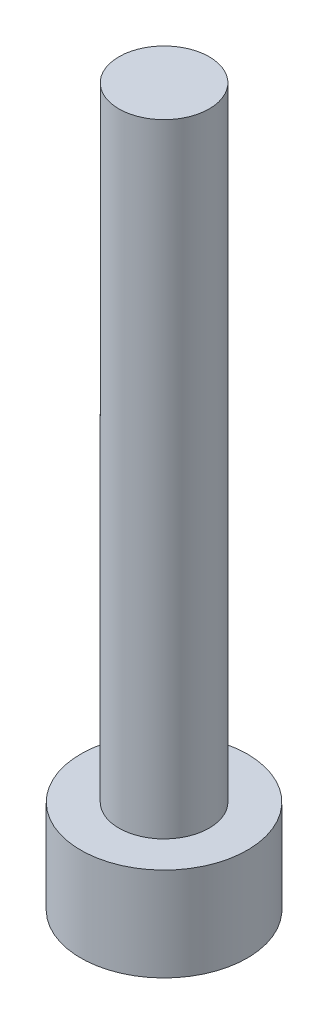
from build123d import *

# Parameters (mm, degrees)
SKETCH1_R           = 1.45
BOSS_EXTRUDE1_DEPTH = 20
SKETCH2_R           = 2.675
BOSS_EXTRUDE2_DEPTH = 3
CUT_EXTRUDE1_DEPTH  = 2


with BuildPart() as part:
    # Sketch1 → Boss-Extrude1 (new body)
    with BuildSketch(Plane(origin=(0, 0, 0), x_dir=(1, 0, 0), z_dir=(0, 1, 0))):
        with Locations(Location((0, 0, 0), (0, 0, 270))):
            Circle(SKETCH1_R)
    extrude(amount=BOSS_EXTRUDE1_DEPTH)

    # Sketch2 → Boss-Extrude2 (add)
    with BuildSketch(Plane.XZ):
        with Locations(Location((0, 0, 0), (0, 0, 270))):
            Circle(SKETCH2_R)
    extrude(amount=BOSS_EXTRUDE2_DEPTH)

    # Sketch3 → Cut-Extrude1 (cut)
    with BuildSketch(Plane.XZ.offset(3)):
        Polygon((1.661945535, 0.487787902), (0.408536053, 1.683181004), (-1.253409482, 1.195393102), (-1.661945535, -0.487787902), (-0.408536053, -1.683181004), (1.253409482, -1.195393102), align=None)
    extrude(amount=-CUT_EXTRUDE1_DEPTH, mode=Mode.SUBTRACT)


solid = part.part
